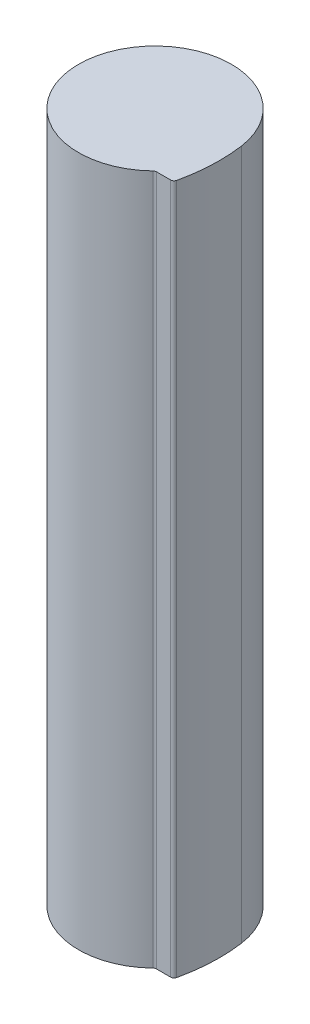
from build123d import *

# Parameters (mm, degrees)
BOSS_EXTRUDE1_DEPTH = 60
FILLET1_R           = 0.3


with BuildPart() as part:
    # Sketch1 → Boss-Extrude1 (new body)
    with BuildSketch(Plane(origin=(0, 0, 0), x_dir=(1, 0, 0), z_dir=(0, 1, 0))):
        with BuildLine():
            Line((4.7, -4.704519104), (6.3, -4.704519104))
            ThreePointArc((6.3, -4.704519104), (6.709132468, -1.910334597), (6.587302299, 0.911015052))
            ThreePointArc((6.587302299, 0.911015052), (-6.303519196, 2.118524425), (4.7, -4.704519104))
        make_face()
    extrude(amount=BOSS_EXTRUDE1_DEPTH)

    # Fillet1
    fillet1_edges = [part.edges().sort_by_distance(p)[0] for p in [
        (6.3, 30, 4.704519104),
        (4.7, 30, 4.704519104),
    ]]
    fillet(fillet1_edges, radius=FILLET1_R)


solid = part.part
